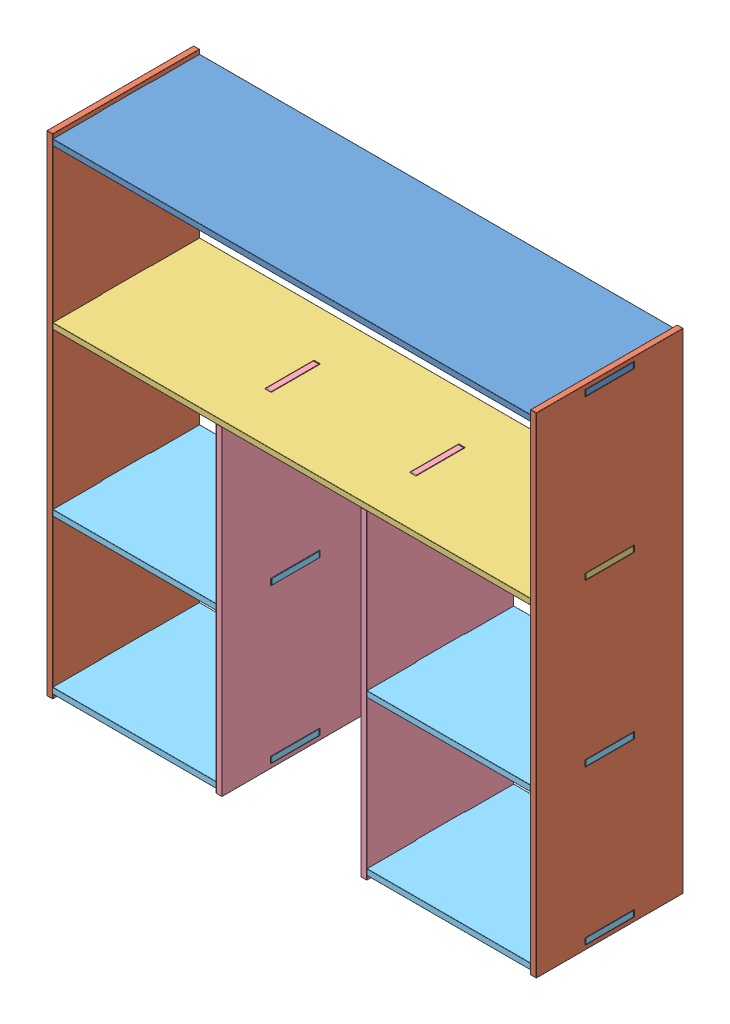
SolidWorks assembly Complete Shelf.SLDASM, configuration Default (file format 11000). Lengths in mm.
Overall size (1000.5 1000.25 300).
10 component instances, 5 part files, 17 mates.
Components (placement in the parent):
- A-1: A.SLDPRT [Default] at (-14.8835 11.023 -3.7114) size (1000 12 300)
- B-1: B.SLDPRT [Default] at (-514.8835 -468.227 -3.7114) size (12 1000 300)
- B-2: B.SLDPRT [Default] at (473.1165 -467.9765 -3.7114) size (12 1000 300)
- C-1: C.SLDPRT [Default] at (-14.8835 -313.977 -3.7114) size (1000 12 300)
- D-1: D.SLDPRT [Default] at (126.8665 -640.977 -3.7114) size (12 666 300)
- D-2: D.SLDPRT [Default] at (-169.1335 -640.977 -3.7114) size (12 666 300)
- E-1: E.SLDPRT [Default] at (305.9915 -959.2265 -3.7114) size (358.25 12 300)
- E-2: E.SLDPRT [Default] at (-336.2585 -959.227 -3.7114) size (358.25 12 300)
- E-3: E.SLDPRT [Default] at (305.9915 -644.2265 -3.7114) size (358.25 12 300)
- E-4: E.SLDPRT [Default] at (-335.7585 -644.477 -3.7114) size (358.25 12 300)
Mates (geometry in assembly coordinates):
- Coincident2: coincident: line of A-1 through (-514.8835 23.023 46.2886) axis (0 -1 0); line of B-1 through (-514.8835 23.023 46.2886) axis (0 -1 0)
- Coincident3: coincident: plane of A-1 through (-14.8835 23.023 -3.7114) normal (0 1 0); plane of B-1 through (-502.8835 23.023 46.2886) normal (0 -1 0)
- Coincident4: coincident: line of A-1 through (485.1165 23.023 -53.7114) axis (0 -1 0); line of B-2 through (485.1165 10.7735 -53.7114) axis (0 1 0)
- Coincident5: coincident: line of B-1 through (-514.8835 -301.977 46.2886) axis (0 -1 0); line of C-1 through (-514.8835 -301.977 46.2886) axis (0 -1 0)
- Coincident6: coincident: plane of B-1 through (-502.8835 -301.977 46.2886) normal (0 -1 0); plane of C-1 through (-14.8835 -301.977 -3.7114) normal (0 1 0)
- Coincident7: coincident: line of C-1 through (139.3665 -301.977 -53.7114) axis (-1 0 0); line of D-1 through (138.8665 -301.977 -53.7114) axis (-1 0 0)
- Coincident8: coincident: line of C-1 through (126.8665 -301.977 -53.7114) axis (0 0 1); line of D-1 through (126.8665 -301.977 -53.7114) axis (0 0 1)
- Coincident9: coincident: line of C-1 through (-156.6335 -301.977 -53.7114) axis (-1 0 0); line of D-2 through (-157.1335 -301.977 -53.7114) axis (-1 0 0)
- Coincident10: coincident: line of C-1 through (-169.1335 -301.977 -53.7114) axis (0 0 1); line of D-2 through (-169.1335 -301.977 -53.7114) axis (0 0 1)
- Coincident11: coincident: line of B-2 through (485.1165 -946.7265 46.2886) axis (0 -1 0); line of E-1 through (485.1165 -947.2265 46.2886) axis (0 -1 0)
- Coincident12: coincident: line of B-2 through (485.1165 -959.2265 46.2886) axis (0 0 -1); line of E-1 through (485.1165 -959.2265 46.2886) axis (0 0 -1)
- Coincident13: coincident: line of D-2 through (-157.1335 -959.227 -53.7114) axis (0 1 0); line of E-2 through (-157.1335 -947.227 -53.7114) axis (0 -1 0)
- Coincident14: coincident: line of D-2 through (-157.1335 -959.227 46.2886) axis (0 0 -1); line of E-2 through (-157.1335 -959.227 46.2886) axis (0 0 -1)
- Coincident15: coincident: line of B-2 through (485.1165 -644.2265 46.2886) axis (0 0 -1); line of E-3 through (485.1165 -644.2265 46.2886) axis (0 0 -1)
- Coincident16: coincident: line of B-2 through (485.1165 -631.7265 46.2886) axis (0 -1 0); line of E-3 through (485.1165 -632.2265 46.2886) axis (0 -1 0)
- Coincident17: coincident: line of B-1 through (-514.8835 -644.477 46.2886) axis (0 0 -1); line of E-4 through (-514.8835 -644.477 -53.7114) axis (0 0 1)
- Coincident18: coincident: line of B-1 through (-514.8835 -631.977 46.2886) axis (0 -1 0); line of E-4 through (-514.8835 -632.477 46.2886) axis (0 -1 0)
